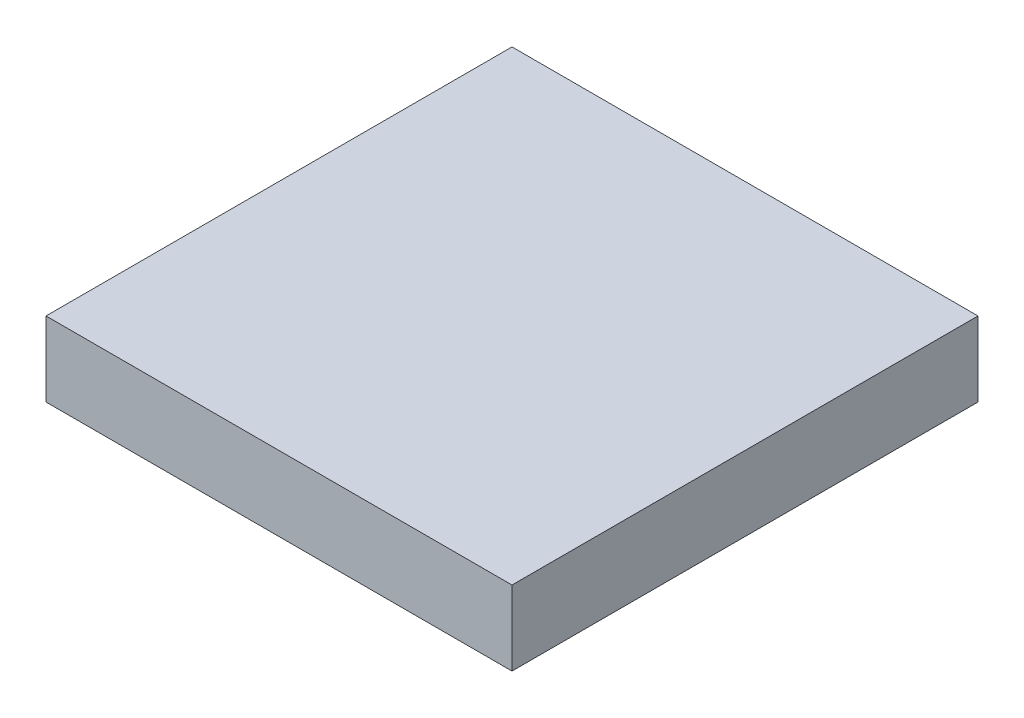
ISO-10303-21;
HEADER;
FILE_DESCRIPTION(('STEP AP214'),'2;1');
FILE_NAME('part.step','',(''),(''),'','','');
FILE_SCHEMA(('AUTOMOTIVE_DESIGN { 1 0 10303 214 1 1 1 1 }'));
ENDSEC;
DATA;
#1=APPLICATION_CONTEXT('core data for automotive mechanical design processes');
#2=APPLICATION_PROTOCOL_DEFINITION('international standard','automotive_design',2000,#1);
#3=PRODUCT_CONTEXT('',#1,'mechanical');
#4=PRODUCT('Part','Part','',(#3));
#5=PRODUCT_RELATED_PRODUCT_CATEGORY('part','',(#4));
#6=PRODUCT_DEFINITION_FORMATION('','',#4);
#7=PRODUCT_DEFINITION_CONTEXT('part definition',#1,'design');
#8=PRODUCT_DEFINITION('design','',#6,#7);
#9=PRODUCT_DEFINITION_SHAPE('','',#8);
#10=(LENGTH_UNIT() NAMED_UNIT(*) SI_UNIT(.MILLI.,.METRE.));
#11=(NAMED_UNIT(*) PLANE_ANGLE_UNIT() SI_UNIT($,.RADIAN.));
#12=(NAMED_UNIT(*) SI_UNIT($,.STERADIAN.) SOLID_ANGLE_UNIT());
#13=UNCERTAINTY_MEASURE_WITH_UNIT(LENGTH_MEASURE(1.E-05),#10,'distance_accuracy_value','');
#14=(GEOMETRIC_REPRESENTATION_CONTEXT(3) GLOBAL_UNCERTAINTY_ASSIGNED_CONTEXT((#13)) GLOBAL_UNIT_ASSIGNED_CONTEXT((#10,
#11,#12)) REPRESENTATION_CONTEXT('',''));
#15=CARTESIAN_POINT('',(0.,0.,0.));
#16=DIRECTION('',(0.,0.,1.));
#17=DIRECTION('',(1.,0.,0.));
#18=AXIS2_PLACEMENT_3D('',#15,#16,#17);
#19=CARTESIAN_POINT('',(-50.,16.,-50.));
#20=DIRECTION('',(1.,0.,0.));
#21=DIRECTION('',(0.,0.,-1.));
#22=AXIS2_PLACEMENT_3D('',#19,#20,#21);
#23=PLANE('',#22);
#24=DIRECTION('',(0.,0.,1.));
#25=VECTOR('',#24,1.);
#26=CARTESIAN_POINT('',(-50.,0.,-50.));
#27=LINE('',#26,#25);
#28=CARTESIAN_POINT('',(-50.,0.,-50.));
#29=VERTEX_POINT('',#28);
#30=CARTESIAN_POINT('',(-50.,0.,50.));
#31=VERTEX_POINT('',#30);
#32=EDGE_CURVE('E70',#29,#31,#27,.T.);
#33=ORIENTED_EDGE('',*,*,#32,.T.);
#34=DIRECTION('',(0.,-1.,0.));
#35=VECTOR('',#34,1.);
#36=CARTESIAN_POINT('',(-50.,16.,50.));
#37=LINE('',#36,#35);
#38=CARTESIAN_POINT('',(-50.,16.,50.));
#39=VERTEX_POINT('',#38);
#40=EDGE_CURVE('E11',#39,#31,#37,.T.);
#41=ORIENTED_EDGE('',*,*,#40,.F.);
#42=DIRECTION('',(0.,0.,1.));
#43=VECTOR('',#42,1.);
#44=CARTESIAN_POINT('',(-50.,16.,-50.));
#45=LINE('',#44,#43);
#46=CARTESIAN_POINT('',(-50.,16.,-50.));
#47=VERTEX_POINT('',#46);
#48=EDGE_CURVE('E88',#47,#39,#45,.T.);
#49=ORIENTED_EDGE('',*,*,#48,.F.);
#50=DIRECTION('',(0.,-1.,0.));
#51=VECTOR('',#50,1.);
#52=CARTESIAN_POINT('',(-50.,16.,-50.));
#53=LINE('',#52,#51);
#54=EDGE_CURVE('E82',#47,#29,#53,.T.);
#55=ORIENTED_EDGE('',*,*,#54,.T.);
#56=EDGE_LOOP('',(#33,#41,#49,#55));
#57=FACE_BOUND('',#56,.T.);
#58=ADVANCED_FACE('F26',(#57),#23,.F.);
#59=CARTESIAN_POINT('',(-50.,16.,50.));
#60=DIRECTION('',(0.,0.,-1.));
#61=DIRECTION('',(-1.,0.,0.));
#62=AXIS2_PLACEMENT_3D('',#59,#60,#61);
#63=PLANE('',#62);
#64=DIRECTION('',(1.,0.,0.));
#65=VECTOR('',#64,1.);
#66=CARTESIAN_POINT('',(-50.,0.,50.));
#67=LINE('',#66,#65);
#68=CARTESIAN_POINT('',(50.,0.,50.));
#69=VERTEX_POINT('',#68);
#70=EDGE_CURVE('E66',#31,#69,#67,.T.);
#71=ORIENTED_EDGE('',*,*,#70,.T.);
#72=DIRECTION('',(0.,-1.,0.));
#73=VECTOR('',#72,1.);
#74=CARTESIAN_POINT('',(50.,16.,50.));
#75=LINE('',#74,#73);
#76=CARTESIAN_POINT('',(50.,16.,50.));
#77=VERTEX_POINT('',#76);
#78=EDGE_CURVE('E33',#77,#69,#75,.T.);
#79=ORIENTED_EDGE('',*,*,#78,.F.);
#80=DIRECTION('',(1.,0.,0.));
#81=VECTOR('',#80,1.);
#82=CARTESIAN_POINT('',(-50.,16.,50.));
#83=LINE('',#82,#81);
#84=EDGE_CURVE('E78',#39,#77,#83,.T.);
#85=ORIENTED_EDGE('',*,*,#84,.F.);
#86=ORIENTED_EDGE('',*,*,#40,.T.);
#87=EDGE_LOOP('',(#71,#79,#85,#86));
#88=FACE_BOUND('',#87,.T.);
#89=ADVANCED_FACE('F77',(#88),#63,.F.);
#90=CARTESIAN_POINT('',(50.,16.,-50.));
#91=DIRECTION('',(-1.,0.,0.));
#92=DIRECTION('',(0.,0.,1.));
#93=AXIS2_PLACEMENT_3D('',#90,#91,#92);
#94=PLANE('',#93);
#95=DIRECTION('',(0.,0.,-1.));
#96=VECTOR('',#95,1.);
#97=CARTESIAN_POINT('',(50.,0.,-50.));
#98=LINE('',#97,#96);
#99=CARTESIAN_POINT('',(50.,0.,-50.));
#100=VERTEX_POINT('',#99);
#101=EDGE_CURVE('E71',#69,#100,#98,.T.);
#102=ORIENTED_EDGE('',*,*,#101,.T.);
#103=DIRECTION('',(0.,-1.,0.));
#104=VECTOR('',#103,1.);
#105=CARTESIAN_POINT('',(50.,16.,-50.));
#106=LINE('',#105,#104);
#107=CARTESIAN_POINT('',(50.,16.,-50.));
#108=VERTEX_POINT('',#107);
#109=EDGE_CURVE('E94',#108,#100,#106,.T.);
#110=ORIENTED_EDGE('',*,*,#109,.F.);
#111=DIRECTION('',(0.,0.,-1.));
#112=VECTOR('',#111,1.);
#113=CARTESIAN_POINT('',(50.,16.,-50.));
#114=LINE('',#113,#112);
#115=EDGE_CURVE('E45',#77,#108,#114,.T.);
#116=ORIENTED_EDGE('',*,*,#115,.F.);
#117=ORIENTED_EDGE('',*,*,#78,.T.);
#118=EDGE_LOOP('',(#102,#110,#116,#117));
#119=FACE_BOUND('',#118,.T.);
#120=ADVANCED_FACE('F97',(#119),#94,.F.);
#121=CARTESIAN_POINT('',(-50.,16.,-50.));
#122=DIRECTION('',(0.,0.,1.));
#123=DIRECTION('',(1.,0.,0.));
#124=AXIS2_PLACEMENT_3D('',#121,#122,#123);
#125=PLANE('',#124);
#126=DIRECTION('',(-1.,0.,0.));
#127=VECTOR('',#126,1.);
#128=CARTESIAN_POINT('',(-50.,0.,-50.));
#129=LINE('',#128,#127);
#130=EDGE_CURVE('E86',#100,#29,#129,.T.);
#131=ORIENTED_EDGE('',*,*,#130,.T.);
#132=ORIENTED_EDGE('',*,*,#54,.F.);
#133=DIRECTION('',(-1.,0.,0.));
#134=VECTOR('',#133,1.);
#135=CARTESIAN_POINT('',(-50.,16.,-50.));
#136=LINE('',#135,#134);
#137=EDGE_CURVE('E40',#108,#47,#136,.T.);
#138=ORIENTED_EDGE('',*,*,#137,.F.);
#139=ORIENTED_EDGE('',*,*,#109,.T.);
#140=EDGE_LOOP('',(#131,#132,#138,#139));
#141=FACE_BOUND('',#140,.T.);
#142=ADVANCED_FACE('F99',(#141),#125,.F.);
#143=CARTESIAN_POINT('',(-50.,16.,50.));
#144=DIRECTION('',(0.,1.,0.));
#145=DIRECTION('',(0.,0.,1.));
#146=AXIS2_PLACEMENT_3D('',#143,#144,#145);
#147=PLANE('',#146);
#148=ORIENTED_EDGE('',*,*,#48,.T.);
#149=ORIENTED_EDGE('',*,*,#84,.T.);
#150=ORIENTED_EDGE('',*,*,#115,.T.);
#151=ORIENTED_EDGE('',*,*,#137,.T.);
#152=EDGE_LOOP('',(#148,#149,#150,#151));
#153=FACE_BOUND('',#152,.T.);
#154=ADVANCED_FACE('F100',(#153),#147,.T.);
#155=CARTESIAN_POINT('',(-50.,0.,50.));
#156=DIRECTION('',(0.,1.,0.));
#157=DIRECTION('',(0.,0.,1.));
#158=AXIS2_PLACEMENT_3D('',#155,#156,#157);
#159=PLANE('',#158);
#160=ORIENTED_EDGE('',*,*,#32,.F.);
#161=ORIENTED_EDGE('',*,*,#130,.F.);
#162=ORIENTED_EDGE('',*,*,#101,.F.);
#163=ORIENTED_EDGE('',*,*,#70,.F.);
#164=EDGE_LOOP('',(#160,#161,#162,#163));
#165=FACE_BOUND('',#164,.T.);
#166=ADVANCED_FACE('F67',(#165),#159,.F.);
#167=CLOSED_SHELL('',(#58,#89,#120,#142,#154,#166));
#168=MANIFOLD_SOLID_BREP('B2',#167);
#169=ADVANCED_BREP_SHAPE_REPRESENTATION('',(#18,#168),#14);
#170=SHAPE_DEFINITION_REPRESENTATION(#9,#169);
ENDSEC;
END-ISO-10303-21;
